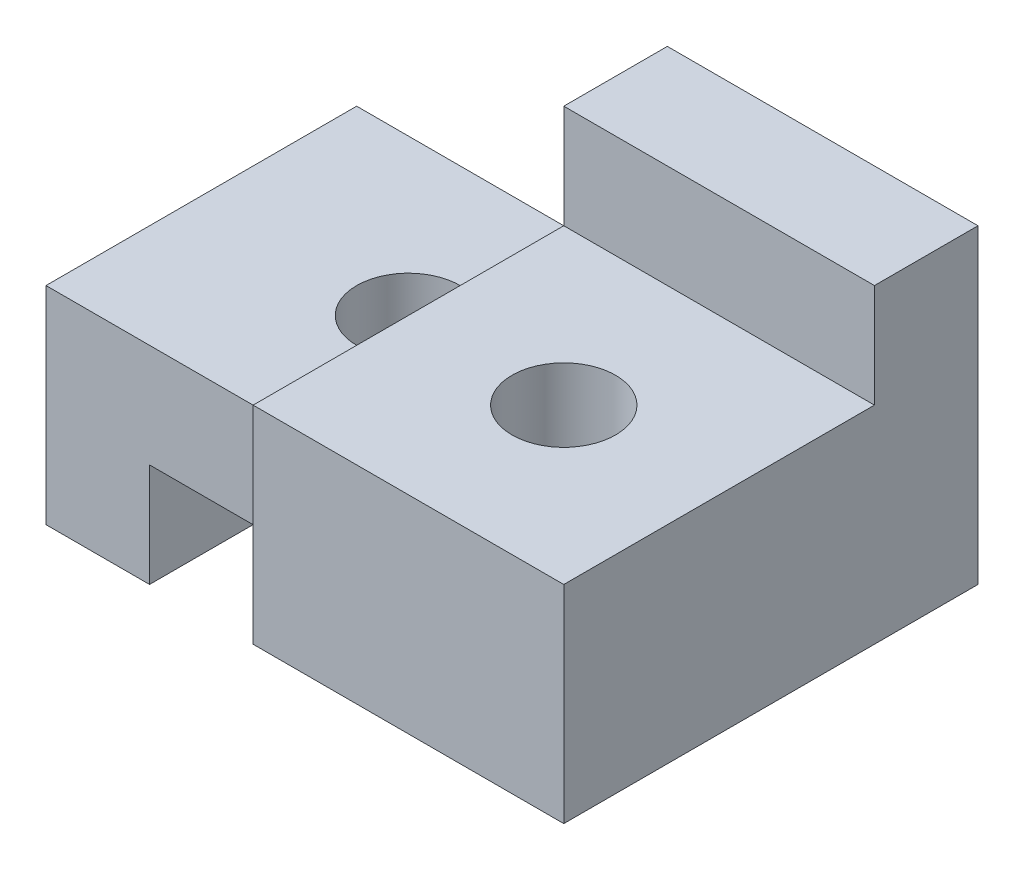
from build123d import *

# Parameters (mm, degrees)
BOSS_EXTRUDE1_DEPTH = 76.2
BOSS_EXTRUDE2_DEPTH = 101.6
SKETCH1_14_W        = 76.2
SKETCH1_14_H        = 25.4
BOSS_EXTRUDE3_DEPTH = 25.4
SKETCH3_R           = 12.7
CUT_EXTRUDE2_DEPTH  = 25.4
SKETCH4_R           = 12.7
CUT_EXTRUDE4_DEPTH  = 50.8


with BuildPart() as part:
    # Sketch1 → Boss-Extrude1 (new body)
    with BuildSketch(Plane.XY):
        Polygon((0, 50.8), (0, 0), (25.4, 0), (25.4, 25.4), (76.2, 25.4), (76.2, 50.8), align=None)
    extrude(amount=BOSS_EXTRUDE1_DEPTH)

    # Sketch1_13 → Boss-Extrude2 (add)
    with BuildSketch(Plane.XY):
        Polygon((76.2, 76.2), (76.2, 50.8), (76.2, 25.4), (152.4, 25.4), (152.4, 76.2), align=None)
    extrude(amount=BOSS_EXTRUDE2_DEPTH)

    # Sketch1_14 → Boss-Extrude3 (add)
    with BuildSketch(Plane.XY):
        with Locations((114.3, 88.9)):
            Rectangle(SKETCH1_14_W, SKETCH1_14_H)
    extrude(amount=BOSS_EXTRUDE3_DEPTH)

    # Sketch3 → Cut-Extrude2 (cut)
    with BuildSketch(Plane(origin=(0, 50.8, 0), x_dir=(1, 0, 0), z_dir=(0, 1, 0))):
        with Locations(Location((50.8, -38.1, 0), (0, 0, 180))):
            Circle(SKETCH3_R)
    extrude(amount=-CUT_EXTRUDE2_DEPTH, mode=Mode.SUBTRACT)

    # Sketch4 → Cut-Extrude4 (cut)
    with BuildSketch(Plane(origin=(0, 76.2, 0), x_dir=(1, 0, 0), z_dir=(0, 1, 0))):
        with Locations(Location((114.3, -63.5, 0), (0, 0, 270))):
            Circle(SKETCH4_R)
    extrude(amount=-CUT_EXTRUDE4_DEPTH, mode=Mode.SUBTRACT)


solid = part.part
